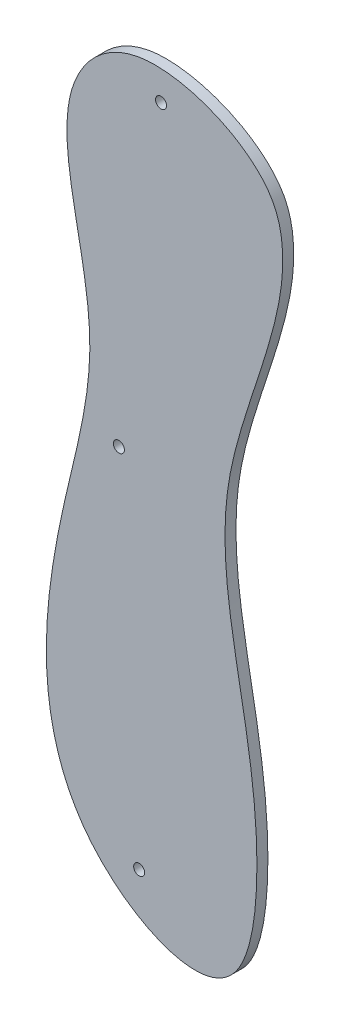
from build123d import *

# Parameters (mm, degrees)
SKETCH1_R           = 1.5875
BOSS_EXTRUDE1_DEPTH = 3.175


with BuildPart() as part:
    # Sketch1 → Boss-Extrude1 (new body)
    with BuildSketch(Plane.XY):
        with BuildLine():
            add(Edge.make_bspline(
                [(0, 177.8), (-9.893677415, 176.211861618), (-29.869291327, 154.781253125), (-7.653167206, 106.335029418), (-27.112116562, 40.352414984), (-32.800551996, -26.054733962), (31.743682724, -55.296221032), (37.062303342, 21.159566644), (12.706648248, 75.771393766), (45.44409514, 135.730512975), (37.52779862, 170.205371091), (13.150899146, 179.910989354), (0, 177.8)],
                knots=[0, 0, 0, 0, 0.060054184, 0.182190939, 0.264365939, 0.430401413, 0.544580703, 0.614929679, 0.773981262, 0.89757275, 0.920174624, 1, 1, 1, 1], degree=3))
        make_face()
        with Locations((6.328651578, 169.56833864)):
            Circle(SKETCH1_R, mode=Mode.SUBTRACT)
        with Locations((-5.852210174, 77.277838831)):
            Circle(SKETCH1_R, mode=Mode.SUBTRACT)
        with Locations((0, -25.735401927)):
            Circle(SKETCH1_R, mode=Mode.SUBTRACT)
    extrude(amount=BOSS_EXTRUDE1_DEPTH)


solid = part.part
